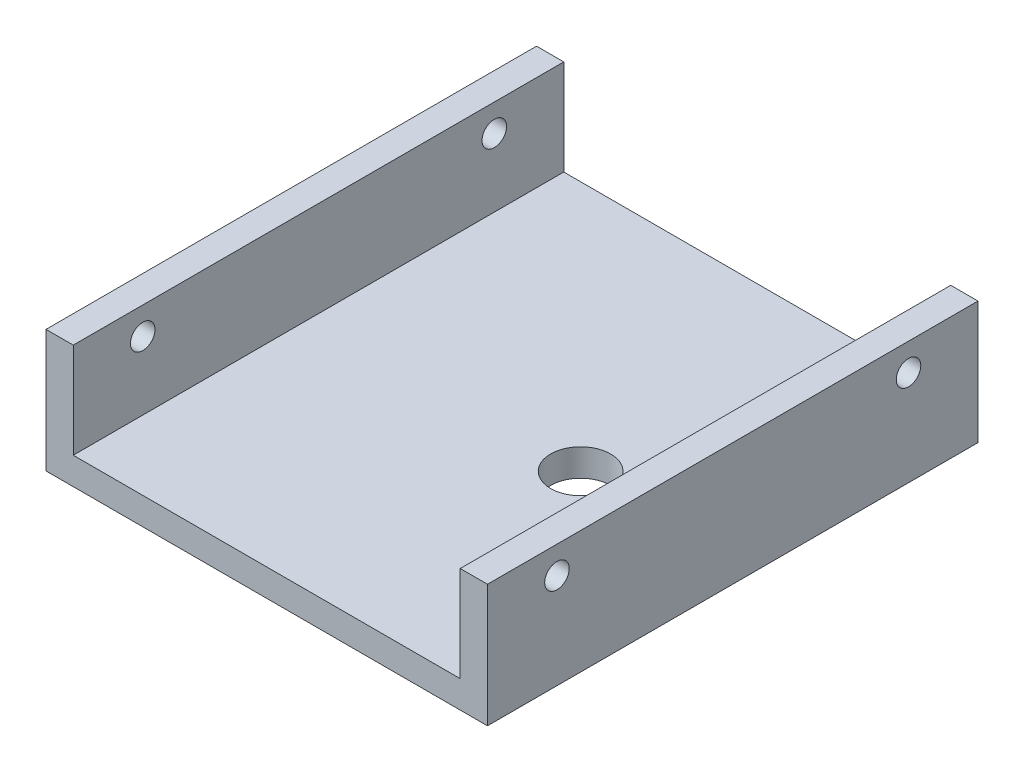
ISO-10303-21;
HEADER;
FILE_DESCRIPTION(('STEP AP214'),'2;1');
FILE_NAME('part.step','',(''),(''),'','','');
FILE_SCHEMA(('AUTOMOTIVE_DESIGN { 1 0 10303 214 1 1 1 1 }'));
ENDSEC;
DATA;
#1=APPLICATION_CONTEXT('core data for automotive mechanical design processes');
#2=APPLICATION_PROTOCOL_DEFINITION('international standard','automotive_design',2000,#1);
#3=PRODUCT_CONTEXT('',#1,'mechanical');
#4=PRODUCT('Part','Part','',(#3));
#5=PRODUCT_RELATED_PRODUCT_CATEGORY('part','',(#4));
#6=PRODUCT_DEFINITION_FORMATION('','',#4);
#7=PRODUCT_DEFINITION_CONTEXT('part definition',#1,'design');
#8=PRODUCT_DEFINITION('design','',#6,#7);
#9=PRODUCT_DEFINITION_SHAPE('','',#8);
#10=(LENGTH_UNIT() NAMED_UNIT(*) SI_UNIT(.MILLI.,.METRE.));
#11=(NAMED_UNIT(*) PLANE_ANGLE_UNIT() SI_UNIT($,.RADIAN.));
#12=(NAMED_UNIT(*) SI_UNIT($,.STERADIAN.) SOLID_ANGLE_UNIT());
#13=UNCERTAINTY_MEASURE_WITH_UNIT(LENGTH_MEASURE(1.E-05),#10,'distance_accuracy_value','');
#14=(GEOMETRIC_REPRESENTATION_CONTEXT(3) GLOBAL_UNCERTAINTY_ASSIGNED_CONTEXT((#13)) GLOBAL_UNIT_ASSIGNED_CONTEXT((#10,
#11,#12)) REPRESENTATION_CONTEXT('',''));
#15=CARTESIAN_POINT('',(0.,0.,0.));
#16=DIRECTION('',(0.,0.,1.));
#17=DIRECTION('',(1.,0.,0.));
#18=AXIS2_PLACEMENT_3D('',#15,#16,#17);
#19=CARTESIAN_POINT('',(-10.,35.,180.));
#20=DIRECTION('',(0.,-1.,0.));
#21=DIRECTION('',(0.,0.,-1.));
#22=AXIS2_PLACEMENT_3D('',#19,#20,#21);
#23=PLANE('',#22);
#24=DIRECTION('',(-1.,0.,0.));
#25=VECTOR('',#24,1.);
#26=CARTESIAN_POINT('',(-10.,35.,0.));
#27=LINE('',#26,#25);
#28=CARTESIAN_POINT('',(0.,35.,0.));
#29=VERTEX_POINT('',#28);
#30=CARTESIAN_POINT('',(-10.,35.,0.));
#31=VERTEX_POINT('',#30);
#32=EDGE_CURVE('E128',#29,#31,#27,.T.);
#33=ORIENTED_EDGE('',*,*,#32,.T.);
#34=DIRECTION('',(0.,0.,-1.));
#35=VECTOR('',#34,1.);
#36=CARTESIAN_POINT('',(-10.,35.,180.));
#37=LINE('',#36,#35);
#38=CARTESIAN_POINT('',(-10.,35.,180.));
#39=VERTEX_POINT('',#38);
#40=EDGE_CURVE('E11',#39,#31,#37,.T.);
#41=ORIENTED_EDGE('',*,*,#40,.F.);
#42=DIRECTION('',(-1.,0.,0.));
#43=VECTOR('',#42,1.);
#44=CARTESIAN_POINT('',(-10.,35.,180.));
#45=LINE('',#44,#43);
#46=CARTESIAN_POINT('',(0.,35.,180.));
#47=VERTEX_POINT('',#46);
#48=EDGE_CURVE('E143',#47,#39,#45,.T.);
#49=ORIENTED_EDGE('',*,*,#48,.F.);
#50=DIRECTION('',(0.,0.,-1.));
#51=VECTOR('',#50,1.);
#52=CARTESIAN_POINT('',(0.,35.,180.));
#53=LINE('',#52,#51);
#54=EDGE_CURVE('E124',#47,#29,#53,.T.);
#55=ORIENTED_EDGE('',*,*,#54,.T.);
#56=EDGE_LOOP('',(#33,#41,#49,#55));
#57=FACE_BOUND('',#56,.T.);
#58=ADVANCED_FACE('F31',(#57),#23,.F.);
#59=CARTESIAN_POINT('',(-10.,35.,180.));
#60=DIRECTION('',(1.,0.,0.));
#61=DIRECTION('',(0.,0.,-1.));
#62=AXIS2_PLACEMENT_3D('',#59,#60,#61);
#63=PLANE('',#62);
#64=CARTESIAN_POINT('',(-10.,25.,25.5));
#65=DIRECTION('',(1.,0.,0.));
#66=DIRECTION('',(0.,0.,-1.));
#67=AXIS2_PLACEMENT_3D('',#64,#65,#66);
#68=CIRCLE('',#67,4.49999999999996);
#69=CARTESIAN_POINT('',(-10.,25.,21.));
#70=VERTEX_POINT('',#69);
#71=EDGE_CURVE('E194',#70,#70,#68,.T.);
#72=ORIENTED_EDGE('',*,*,#71,.T.);
#73=EDGE_LOOP('',(#72));
#74=FACE_BOUND('',#73,.T.);
#75=CARTESIAN_POINT('',(-10.,25.,154.5));
#76=DIRECTION('',(1.,0.,0.));
#77=DIRECTION('',(0.,0.,-1.));
#78=AXIS2_PLACEMENT_3D('',#75,#76,#77);
#79=CIRCLE('',#78,4.49999999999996);
#80=CARTESIAN_POINT('',(-10.,25.,150.));
#81=VERTEX_POINT('',#80);
#82=EDGE_CURVE('E182',#81,#81,#79,.T.);
#83=ORIENTED_EDGE('',*,*,#82,.T.);
#84=EDGE_LOOP('',(#83));
#85=FACE_BOUND('',#84,.T.);
#86=DIRECTION('',(0.,-1.,0.));
#87=VECTOR('',#86,1.);
#88=CARTESIAN_POINT('',(-10.,35.,0.));
#89=LINE('',#88,#87);
#90=CARTESIAN_POINT('',(-10.,-10.,0.));
#91=VERTEX_POINT('',#90);
#92=EDGE_CURVE('E131',#31,#91,#89,.T.);
#93=ORIENTED_EDGE('',*,*,#92,.T.);
#94=DIRECTION('',(0.,0.,-1.));
#95=VECTOR('',#94,1.);
#96=CARTESIAN_POINT('',(-10.,-10.,180.));
#97=LINE('',#96,#95);
#98=CARTESIAN_POINT('',(-10.,-10.,180.));
#99=VERTEX_POINT('',#98);
#100=EDGE_CURVE('E40',#99,#91,#97,.T.);
#101=ORIENTED_EDGE('',*,*,#100,.F.);
#102=DIRECTION('',(0.,-1.,0.));
#103=VECTOR('',#102,1.);
#104=CARTESIAN_POINT('',(-10.,35.,180.));
#105=LINE('',#104,#103);
#106=EDGE_CURVE('E91',#39,#99,#105,.T.);
#107=ORIENTED_EDGE('',*,*,#106,.F.);
#108=ORIENTED_EDGE('',*,*,#40,.T.);
#109=EDGE_LOOP('',(#93,#101,#107,#108));
#110=FACE_BOUND('',#109,.T.);
#111=ADVANCED_FACE('F207',(#74,#85,#110),#63,.F.);
#112=CARTESIAN_POINT('',(-10.,-10.,180.));
#113=DIRECTION('',(0.,1.,0.));
#114=DIRECTION('',(0.,0.,1.));
#115=AXIS2_PLACEMENT_3D('',#112,#113,#114);
#116=PLANE('',#115);
#117=CARTESIAN_POINT('',(98.18,-10.,92.));
#118=DIRECTION('',(0.,-1.,0.));
#119=DIRECTION('',(0.,0.,-1.));
#120=AXIS2_PLACEMENT_3D('',#117,#118,#119);
#121=CIRCLE('',#120,11.);
#122=CARTESIAN_POINT('',(98.18,-10.,81.));
#123=VERTEX_POINT('',#122);
#124=EDGE_CURVE('E200',#123,#123,#121,.T.);
#125=ORIENTED_EDGE('',*,*,#124,.F.);
#126=EDGE_LOOP('',(#125));
#127=FACE_BOUND('',#126,.T.);
#128=DIRECTION('',(1.,0.,0.));
#129=VECTOR('',#128,1.);
#130=CARTESIAN_POINT('',(-10.,-10.,0.));
#131=LINE('',#130,#129);
#132=CARTESIAN_POINT('',(152.,-10.,0.));
#133=VERTEX_POINT('',#132);
#134=EDGE_CURVE('E134',#91,#133,#131,.T.);
#135=ORIENTED_EDGE('',*,*,#134,.T.);
#136=DIRECTION('',(0.,0.,-1.));
#137=VECTOR('',#136,1.);
#138=CARTESIAN_POINT('',(152.,-10.,180.));
#139=LINE('',#138,#137);
#140=CARTESIAN_POINT('',(152.,-10.,180.));
#141=VERTEX_POINT('',#140);
#142=EDGE_CURVE('E150',#141,#133,#139,.T.);
#143=ORIENTED_EDGE('',*,*,#142,.F.);
#144=DIRECTION('',(1.,0.,0.));
#145=VECTOR('',#144,1.);
#146=CARTESIAN_POINT('',(-10.,-10.,180.));
#147=LINE('',#146,#145);
#148=EDGE_CURVE('E159',#99,#141,#147,.T.);
#149=ORIENTED_EDGE('',*,*,#148,.F.);
#150=ORIENTED_EDGE('',*,*,#100,.T.);
#151=EDGE_LOOP('',(#135,#143,#149,#150));
#152=FACE_BOUND('',#151,.T.);
#153=ADVANCED_FACE('F157',(#127,#152),#116,.F.);
#154=CARTESIAN_POINT('',(152.,-10.,180.));
#155=DIRECTION('',(-1.,0.,0.));
#156=DIRECTION('',(0.,0.,1.));
#157=AXIS2_PLACEMENT_3D('',#154,#155,#156);
#158=PLANE('',#157);
#159=CARTESIAN_POINT('',(152.,25.,25.5));
#160=DIRECTION('',(1.,0.,0.));
#161=DIRECTION('',(0.,0.,-1.));
#162=AXIS2_PLACEMENT_3D('',#159,#160,#161);
#163=CIRCLE('',#162,4.49999999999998);
#164=CARTESIAN_POINT('',(152.,25.,21.));
#165=VERTEX_POINT('',#164);
#166=EDGE_CURVE('E188',#165,#165,#163,.T.);
#167=ORIENTED_EDGE('',*,*,#166,.F.);
#168=EDGE_LOOP('',(#167));
#169=FACE_BOUND('',#168,.T.);
#170=CARTESIAN_POINT('',(152.,25.,154.5));
#171=DIRECTION('',(1.,0.,0.));
#172=DIRECTION('',(0.,0.,-1.));
#173=AXIS2_PLACEMENT_3D('',#170,#171,#172);
#174=CIRCLE('',#173,4.49999999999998);
#175=CARTESIAN_POINT('',(152.,25.,150.));
#176=VERTEX_POINT('',#175);
#177=EDGE_CURVE('E179',#176,#176,#174,.T.);
#178=ORIENTED_EDGE('',*,*,#177,.F.);
#179=EDGE_LOOP('',(#178));
#180=FACE_BOUND('',#179,.T.);
#181=DIRECTION('',(0.,1.,0.));
#182=VECTOR('',#181,1.);
#183=CARTESIAN_POINT('',(152.,-10.,0.));
#184=LINE('',#183,#182);
#185=CARTESIAN_POINT('',(152.,35.,0.));
#186=VERTEX_POINT('',#185);
#187=EDGE_CURVE('E136',#133,#186,#184,.T.);
#188=ORIENTED_EDGE('',*,*,#187,.T.);
#189=DIRECTION('',(0.,0.,-1.));
#190=VECTOR('',#189,1.);
#191=CARTESIAN_POINT('',(152.,35.,180.));
#192=LINE('',#191,#190);
#193=CARTESIAN_POINT('',(152.,35.,180.));
#194=VERTEX_POINT('',#193);
#195=EDGE_CURVE('E147',#194,#186,#192,.T.);
#196=ORIENTED_EDGE('',*,*,#195,.F.);
#197=DIRECTION('',(0.,1.,0.));
#198=VECTOR('',#197,1.);
#199=CARTESIAN_POINT('',(152.,-10.,180.));
#200=LINE('',#199,#198);
#201=EDGE_CURVE('E171',#141,#194,#200,.T.);
#202=ORIENTED_EDGE('',*,*,#201,.F.);
#203=ORIENTED_EDGE('',*,*,#142,.T.);
#204=EDGE_LOOP('',(#188,#196,#202,#203));
#205=FACE_BOUND('',#204,.T.);
#206=ADVANCED_FACE('F167',(#169,#180,#205),#158,.F.);
#207=CARTESIAN_POINT('',(142.,35.,180.));
#208=DIRECTION('',(0.,-1.,0.));
#209=DIRECTION('',(0.,0.,-1.));
#210=AXIS2_PLACEMENT_3D('',#207,#208,#209);
#211=PLANE('',#210);
#212=DIRECTION('',(-1.,0.,0.));
#213=VECTOR('',#212,1.);
#214=CARTESIAN_POINT('',(142.,35.,0.));
#215=LINE('',#214,#213);
#216=CARTESIAN_POINT('',(142.,35.,0.));
#217=VERTEX_POINT('',#216);
#218=EDGE_CURVE('E138',#186,#217,#215,.T.);
#219=ORIENTED_EDGE('',*,*,#218,.T.);
#220=DIRECTION('',(0.,0.,-1.));
#221=VECTOR('',#220,1.);
#222=CARTESIAN_POINT('',(142.,35.,180.));
#223=LINE('',#222,#221);
#224=CARTESIAN_POINT('',(142.,35.,180.));
#225=VERTEX_POINT('',#224);
#226=EDGE_CURVE('E119',#225,#217,#223,.T.);
#227=ORIENTED_EDGE('',*,*,#226,.F.);
#228=DIRECTION('',(-1.,0.,0.));
#229=VECTOR('',#228,1.);
#230=CARTESIAN_POINT('',(142.,35.,180.));
#231=LINE('',#230,#229);
#232=EDGE_CURVE('E110',#194,#225,#231,.T.);
#233=ORIENTED_EDGE('',*,*,#232,.F.);
#234=ORIENTED_EDGE('',*,*,#195,.T.);
#235=EDGE_LOOP('',(#219,#227,#233,#234));
#236=FACE_BOUND('',#235,.T.);
#237=ADVANCED_FACE('F170',(#236),#211,.F.);
#238=CARTESIAN_POINT('',(142.,0.,180.));
#239=DIRECTION('',(1.,0.,0.));
#240=DIRECTION('',(0.,0.,-1.));
#241=AXIS2_PLACEMENT_3D('',#238,#239,#240);
#242=PLANE('',#241);
#243=CARTESIAN_POINT('',(142.,25.,25.5));
#244=DIRECTION('',(1.,0.,0.));
#245=DIRECTION('',(0.,0.,-1.));
#246=AXIS2_PLACEMENT_3D('',#243,#244,#245);
#247=CIRCLE('',#246,4.49999999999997);
#248=CARTESIAN_POINT('',(142.,25.,21.));
#249=VERTEX_POINT('',#248);
#250=EDGE_CURVE('E185',#249,#249,#247,.T.);
#251=ORIENTED_EDGE('',*,*,#250,.T.);
#252=EDGE_LOOP('',(#251));
#253=FACE_BOUND('',#252,.T.);
#254=CARTESIAN_POINT('',(142.,25.,154.5));
#255=DIRECTION('',(1.,0.,0.));
#256=DIRECTION('',(0.,0.,-1.));
#257=AXIS2_PLACEMENT_3D('',#254,#255,#256);
#258=CIRCLE('',#257,4.49999999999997);
#259=CARTESIAN_POINT('',(142.,25.,150.));
#260=VERTEX_POINT('',#259);
#261=EDGE_CURVE('E132',#260,#260,#258,.T.);
#262=ORIENTED_EDGE('',*,*,#261,.T.);
#263=EDGE_LOOP('',(#262));
#264=FACE_BOUND('',#263,.T.);
#265=DIRECTION('',(0.,-1.,0.));
#266=VECTOR('',#265,1.);
#267=CARTESIAN_POINT('',(142.,0.,0.));
#268=LINE('',#267,#266);
#269=CARTESIAN_POINT('',(142.,0.,0.));
#270=VERTEX_POINT('',#269);
#271=EDGE_CURVE('E118',#217,#270,#268,.T.);
#272=ORIENTED_EDGE('',*,*,#271,.T.);
#273=DIRECTION('',(0.,0.,-1.));
#274=VECTOR('',#273,1.);
#275=CARTESIAN_POINT('',(142.,0.,180.));
#276=LINE('',#275,#274);
#277=CARTESIAN_POINT('',(142.,0.,180.));
#278=VERTEX_POINT('',#277);
#279=EDGE_CURVE('E115',#278,#270,#276,.T.);
#280=ORIENTED_EDGE('',*,*,#279,.F.);
#281=DIRECTION('',(0.,-1.,0.));
#282=VECTOR('',#281,1.);
#283=CARTESIAN_POINT('',(142.,0.,180.));
#284=LINE('',#283,#282);
#285=EDGE_CURVE('E104',#225,#278,#284,.T.);
#286=ORIENTED_EDGE('',*,*,#285,.F.);
#287=ORIENTED_EDGE('',*,*,#226,.T.);
#288=EDGE_LOOP('',(#272,#280,#286,#287));
#289=FACE_BOUND('',#288,.T.);
#290=ADVANCED_FACE('F116',(#253,#264,#289),#242,.F.);
#291=CARTESIAN_POINT('',(0.,0.,180.));
#292=DIRECTION('',(0.,-1.,0.));
#293=DIRECTION('',(0.,0.,-1.));
#294=AXIS2_PLACEMENT_3D('',#291,#292,#293);
#295=PLANE('',#294);
#296=CARTESIAN_POINT('',(98.18,0.,92.));
#297=DIRECTION('',(0.,-1.,0.));
#298=DIRECTION('',(0.,0.,-1.));
#299=AXIS2_PLACEMENT_3D('',#296,#297,#298);
#300=CIRCLE('',#299,11.);
#301=CARTESIAN_POINT('',(98.18,0.,81.));
#302=VERTEX_POINT('',#301);
#303=EDGE_CURVE('E197',#302,#302,#300,.T.);
#304=ORIENTED_EDGE('',*,*,#303,.T.);
#305=EDGE_LOOP('',(#304));
#306=FACE_BOUND('',#305,.T.);
#307=DIRECTION('',(-1.,0.,0.));
#308=VECTOR('',#307,1.);
#309=CARTESIAN_POINT('',(0.,0.,0.));
#310=LINE('',#309,#308);
#311=CARTESIAN_POINT('',(0.,0.,0.));
#312=VERTEX_POINT('',#311);
#313=EDGE_CURVE('E77',#270,#312,#310,.T.);
#314=ORIENTED_EDGE('',*,*,#313,.T.);
#315=DIRECTION('',(0.,0.,-1.));
#316=VECTOR('',#315,1.);
#317=CARTESIAN_POINT('',(0.,0.,180.));
#318=LINE('',#317,#316);
#319=CARTESIAN_POINT('',(0.,0.,180.));
#320=VERTEX_POINT('',#319);
#321=EDGE_CURVE('E120',#320,#312,#318,.T.);
#322=ORIENTED_EDGE('',*,*,#321,.F.);
#323=DIRECTION('',(-1.,0.,0.));
#324=VECTOR('',#323,1.);
#325=CARTESIAN_POINT('',(0.,0.,180.));
#326=LINE('',#325,#324);
#327=EDGE_CURVE('E108',#278,#320,#326,.T.);
#328=ORIENTED_EDGE('',*,*,#327,.F.);
#329=ORIENTED_EDGE('',*,*,#279,.T.);
#330=EDGE_LOOP('',(#314,#322,#328,#329));
#331=FACE_BOUND('',#330,.T.);
#332=ADVANCED_FACE('F122',(#306,#331),#295,.F.);
#333=CARTESIAN_POINT('',(0.,35.,180.));
#334=DIRECTION('',(-1.,0.,0.));
#335=DIRECTION('',(0.,-1.,0.));
#336=AXIS2_PLACEMENT_3D('',#333,#334,#335);
#337=PLANE('',#336);
#338=CARTESIAN_POINT('',(0.,25.,25.5));
#339=DIRECTION('',(-1.,0.,0.));
#340=DIRECTION('',(0.,-1.,0.));
#341=AXIS2_PLACEMENT_3D('',#338,#339,#340);
#342=CIRCLE('',#341,4.49999999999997);
#343=CARTESIAN_POINT('',(0.,20.5,25.5));
#344=VERTEX_POINT('',#343);
#345=EDGE_CURVE('E191',#344,#344,#342,.T.);
#346=ORIENTED_EDGE('',*,*,#345,.T.);
#347=EDGE_LOOP('',(#346));
#348=FACE_BOUND('',#347,.T.);
#349=CARTESIAN_POINT('',(0.,25.,154.5));
#350=DIRECTION('',(-1.,0.,0.));
#351=DIRECTION('',(0.,-1.,0.));
#352=AXIS2_PLACEMENT_3D('',#349,#350,#351);
#353=CIRCLE('',#352,4.49999999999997);
#354=CARTESIAN_POINT('',(0.,20.5,154.5));
#355=VERTEX_POINT('',#354);
#356=EDGE_CURVE('E34',#355,#355,#353,.T.);
#357=ORIENTED_EDGE('',*,*,#356,.T.);
#358=EDGE_LOOP('',(#357));
#359=FACE_BOUND('',#358,.T.);
#360=DIRECTION('',(0.,1.,0.));
#361=VECTOR('',#360,1.);
#362=CARTESIAN_POINT('',(0.,35.,0.));
#363=LINE('',#362,#361);
#364=EDGE_CURVE('E83',#312,#29,#363,.T.);
#365=ORIENTED_EDGE('',*,*,#364,.T.);
#366=ORIENTED_EDGE('',*,*,#54,.F.);
#367=DIRECTION('',(0.,1.,0.));
#368=VECTOR('',#367,1.);
#369=CARTESIAN_POINT('',(0.,35.,180.));
#370=LINE('',#369,#368);
#371=EDGE_CURVE('E48',#320,#47,#370,.T.);
#372=ORIENTED_EDGE('',*,*,#371,.F.);
#373=ORIENTED_EDGE('',*,*,#321,.T.);
#374=EDGE_LOOP('',(#365,#366,#372,#373));
#375=FACE_BOUND('',#374,.T.);
#376=ADVANCED_FACE('F222',(#348,#359,#375),#337,.F.);
#377=CARTESIAN_POINT('',(142.,35.,180.));
#378=DIRECTION('',(0.,0.,1.));
#379=DIRECTION('',(1.,0.,0.));
#380=AXIS2_PLACEMENT_3D('',#377,#378,#379);
#381=PLANE('',#380);
#382=ORIENTED_EDGE('',*,*,#48,.T.);
#383=ORIENTED_EDGE('',*,*,#106,.T.);
#384=ORIENTED_EDGE('',*,*,#148,.T.);
#385=ORIENTED_EDGE('',*,*,#201,.T.);
#386=ORIENTED_EDGE('',*,*,#232,.T.);
#387=ORIENTED_EDGE('',*,*,#285,.T.);
#388=ORIENTED_EDGE('',*,*,#327,.T.);
#389=ORIENTED_EDGE('',*,*,#371,.T.);
#390=EDGE_LOOP('',(#382,#383,#384,#385,#386,#387,#388,#389));
#391=FACE_BOUND('',#390,.T.);
#392=ADVANCED_FACE('F106',(#391),#381,.T.);
#393=CARTESIAN_POINT('',(142.,35.,0.));
#394=DIRECTION('',(0.,0.,1.));
#395=DIRECTION('',(1.,0.,0.));
#396=AXIS2_PLACEMENT_3D('',#393,#394,#395);
#397=PLANE('',#396);
#398=ORIENTED_EDGE('',*,*,#32,.F.);
#399=ORIENTED_EDGE('',*,*,#364,.F.);
#400=ORIENTED_EDGE('',*,*,#313,.F.);
#401=ORIENTED_EDGE('',*,*,#271,.F.);
#402=ORIENTED_EDGE('',*,*,#218,.F.);
#403=ORIENTED_EDGE('',*,*,#187,.F.);
#404=ORIENTED_EDGE('',*,*,#134,.F.);
#405=ORIENTED_EDGE('',*,*,#92,.F.);
#406=EDGE_LOOP('',(#398,#399,#400,#401,#402,#403,#404,#405));
#407=FACE_BOUND('',#406,.T.);
#408=ADVANCED_FACE('F163',(#407),#397,.F.);
#409=CARTESIAN_POINT('',(152.,25.,154.5));
#410=DIRECTION('',(1.,0.,0.));
#411=DIRECTION('',(0.,0.,-1.));
#412=AXIS2_PLACEMENT_3D('',#409,#410,#411);
#413=CYLINDRICAL_SURFACE('',#412,4.49999999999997);
#414=ORIENTED_EDGE('',*,*,#82,.F.);
#415=EDGE_LOOP('',(#414));
#416=FACE_BOUND('',#415,.T.);
#417=ORIENTED_EDGE('',*,*,#356,.F.);
#418=EDGE_LOOP('',(#417));
#419=FACE_BOUND('',#418,.T.);
#420=ADVANCED_FACE('F290',(#416,#419),#413,.F.);
#421=ORIENTED_EDGE('',*,*,#177,.T.);
#422=EDGE_LOOP('',(#421));
#423=FACE_BOUND('',#422,.T.);
#424=ORIENTED_EDGE('',*,*,#261,.F.);
#425=EDGE_LOOP('',(#424));
#426=FACE_BOUND('',#425,.T.);
#427=ADVANCED_FACE('F282',(#423,#426),#413,.F.);
#428=CARTESIAN_POINT('',(152.,25.,25.5));
#429=DIRECTION('',(1.,0.,0.));
#430=DIRECTION('',(0.,0.,-1.));
#431=AXIS2_PLACEMENT_3D('',#428,#429,#430);
#432=CYLINDRICAL_SURFACE('',#431,4.49999999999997);
#433=ORIENTED_EDGE('',*,*,#166,.T.);
#434=EDGE_LOOP('',(#433));
#435=FACE_BOUND('',#434,.T.);
#436=ORIENTED_EDGE('',*,*,#250,.F.);
#437=EDGE_LOOP('',(#436));
#438=FACE_BOUND('',#437,.T.);
#439=ADVANCED_FACE('F275',(#435,#438),#432,.F.);
#440=CARTESIAN_POINT('',(152.,25.,25.5));
#441=DIRECTION('',(1.,0.,0.));
#442=DIRECTION('',(0.,0.,-1.));
#443=AXIS2_PLACEMENT_3D('',#440,#441,#442);
#444=CYLINDRICAL_SURFACE('',#443,4.49999999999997);
#445=ORIENTED_EDGE('',*,*,#71,.F.);
#446=EDGE_LOOP('',(#445));
#447=FACE_BOUND('',#446,.T.);
#448=ORIENTED_EDGE('',*,*,#345,.F.);
#449=EDGE_LOOP('',(#448));
#450=FACE_BOUND('',#449,.T.);
#451=ADVANCED_FACE('F265',(#447,#450),#444,.F.);
#452=CARTESIAN_POINT('',(98.18,-10.,92.));
#453=DIRECTION('',(0.,-1.,0.));
#454=DIRECTION('',(0.,0.,-1.));
#455=AXIS2_PLACEMENT_3D('',#452,#453,#454);
#456=CYLINDRICAL_SURFACE('',#455,11.);
#457=ORIENTED_EDGE('',*,*,#303,.F.);
#458=EDGE_LOOP('',(#457));
#459=FACE_BOUND('',#458,.T.);
#460=ORIENTED_EDGE('',*,*,#124,.T.);
#461=EDGE_LOOP('',(#460));
#462=FACE_BOUND('',#461,.T.);
#463=ADVANCED_FACE('F204',(#459,#462),#456,.F.);
#464=CLOSED_SHELL('',(#58,#111,#153,#206,#237,#290,#332,#376,#392,#408,#420,#427,#439,#451,#463));
#465=MANIFOLD_SOLID_BREP('B2',#464);
#466=ADVANCED_BREP_SHAPE_REPRESENTATION('',(#18,#465),#14);
#467=SHAPE_DEFINITION_REPRESENTATION(#9,#466);
ENDSEC;
END-ISO-10303-21;
